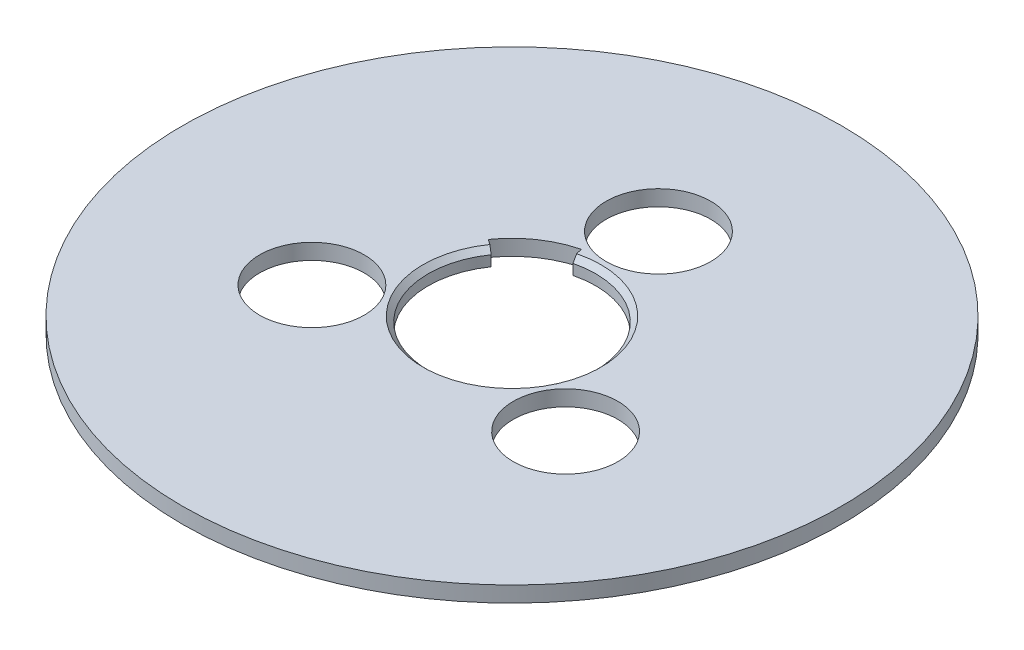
ISO-10303-21;
HEADER;
FILE_DESCRIPTION(('STEP AP214'),'2;1');
FILE_NAME('part.step','',(''),(''),'','','');
FILE_SCHEMA(('AUTOMOTIVE_DESIGN { 1 0 10303 214 1 1 1 1 }'));
ENDSEC;
DATA;
#1=APPLICATION_CONTEXT('core data for automotive mechanical design processes');
#2=APPLICATION_PROTOCOL_DEFINITION('international standard','automotive_design',2000,#1);
#3=PRODUCT_CONTEXT('',#1,'mechanical');
#4=PRODUCT('Part','Part','',(#3));
#5=PRODUCT_RELATED_PRODUCT_CATEGORY('part','',(#4));
#6=PRODUCT_DEFINITION_FORMATION('','',#4);
#7=PRODUCT_DEFINITION_CONTEXT('part definition',#1,'design');
#8=PRODUCT_DEFINITION('design','',#6,#7);
#9=PRODUCT_DEFINITION_SHAPE('','',#8);
#10=(LENGTH_UNIT() NAMED_UNIT(*) SI_UNIT(.MILLI.,.METRE.));
#11=(NAMED_UNIT(*) PLANE_ANGLE_UNIT() SI_UNIT($,.RADIAN.));
#12=(NAMED_UNIT(*) SI_UNIT($,.STERADIAN.) SOLID_ANGLE_UNIT());
#13=UNCERTAINTY_MEASURE_WITH_UNIT(LENGTH_MEASURE(1.E-05),#10,'distance_accuracy_value','');
#14=(GEOMETRIC_REPRESENTATION_CONTEXT(3) GLOBAL_UNCERTAINTY_ASSIGNED_CONTEXT((#13)) GLOBAL_UNIT_ASSIGNED_CONTEXT((#10,
#11,#12)) REPRESENTATION_CONTEXT('',''));
#15=CARTESIAN_POINT('',(0.,0.,0.));
#16=DIRECTION('',(0.,0.,1.));
#17=DIRECTION('',(1.,0.,0.));
#18=AXIS2_PLACEMENT_3D('',#15,#16,#17);
#19=CARTESIAN_POINT('',(0.,-1.5,0.));
#20=DIRECTION('',(0.,1.,0.));
#21=DIRECTION('',(0.,0.,1.));
#22=AXIS2_PLACEMENT_3D('',#19,#20,#21);
#23=CYLINDRICAL_SURFACE('',#22,31.5);
#24=CARTESIAN_POINT('',(0.,-1.5,0.));
#25=DIRECTION('',(0.,1.,0.));
#26=DIRECTION('',(0.,0.,1.));
#27=AXIS2_PLACEMENT_3D('',#24,#25,#26);
#28=CIRCLE('',#27,31.5);
#29=CARTESIAN_POINT('',(0.,-1.5,31.5));
#30=VERTEX_POINT('',#29);
#31=EDGE_CURVE('E122',#30,#30,#28,.T.);
#32=ORIENTED_EDGE('',*,*,#31,.T.);
#33=EDGE_LOOP('',(#32));
#34=FACE_BOUND('',#33,.T.);
#35=CARTESIAN_POINT('',(0.,0.,0.));
#36=DIRECTION('',(0.,1.,0.));
#37=DIRECTION('',(0.,0.,1.));
#38=AXIS2_PLACEMENT_3D('',#35,#36,#37);
#39=CIRCLE('',#38,31.5);
#40=CARTESIAN_POINT('',(0.,0.,31.5));
#41=VERTEX_POINT('',#40);
#42=EDGE_CURVE('E119',#41,#41,#39,.T.);
#43=ORIENTED_EDGE('',*,*,#42,.F.);
#44=EDGE_LOOP('',(#43));
#45=FACE_BOUND('',#44,.T.);
#46=ADVANCED_FACE('F33',(#34,#45),#23,.T.);
#47=CARTESIAN_POINT('',(0.,-1.5,0.));
#48=DIRECTION('',(0.,1.,0.));
#49=DIRECTION('',(0.,0.,1.));
#50=AXIS2_PLACEMENT_3D('',#47,#48,#49);
#51=PLANE('',#50);
#52=CARTESIAN_POINT('',(-12.1243556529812,-1.5,7.00000000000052));
#53=DIRECTION('',(0.,1.,0.));
#54=DIRECTION('',(0.,0.,1.));
#55=AXIS2_PLACEMENT_3D('',#52,#53,#54);
#56=CIRCLE('',#55,5.00000000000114);
#57=CARTESIAN_POINT('',(-12.1243556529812,-1.5,12.0000000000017));
#58=VERTEX_POINT('',#57);
#59=EDGE_CURVE('E171',#58,#58,#56,.T.);
#60=ORIENTED_EDGE('',*,*,#59,.T.);
#61=EDGE_LOOP('',(#60));
#62=FACE_BOUND('',#61,.T.);
#63=CARTESIAN_POINT('',(12.124355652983,-1.5,6.99999999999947));
#64=DIRECTION('',(0.,1.,0.));
#65=DIRECTION('',(0.,0.,1.));
#66=AXIS2_PLACEMENT_3D('',#63,#64,#65);
#67=CIRCLE('',#66,5.00000000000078);
#68=CARTESIAN_POINT('',(12.124355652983,-1.5,12.0000000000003));
#69=VERTEX_POINT('',#68);
#70=EDGE_CURVE('E179',#69,#69,#67,.T.);
#71=ORIENTED_EDGE('',*,*,#70,.T.);
#72=EDGE_LOOP('',(#71));
#73=FACE_BOUND('',#72,.T.);
#74=CARTESIAN_POINT('',(0.,-1.5,-14.));
#75=DIRECTION('',(0.,1.,0.));
#76=DIRECTION('',(0.,0.,1.));
#77=AXIS2_PLACEMENT_3D('',#74,#75,#76);
#78=CIRCLE('',#77,5.);
#79=CARTESIAN_POINT('',(0.,-1.5,-9.));
#80=VERTEX_POINT('',#79);
#81=EDGE_CURVE('E113',#80,#80,#78,.T.);
#82=ORIENTED_EDGE('',*,*,#81,.T.);
#83=EDGE_LOOP('',(#82));
#84=FACE_BOUND('',#83,.T.);
#85=DIRECTION('',(-0.242355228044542,0.,-0.970187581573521));
#86=VECTOR('',#85,1.);
#87=CARTESIAN_POINT('',(-1.93884182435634,-1.5,-7.76150065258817));
#88=LINE('',#87,#86);
#89=CARTESIAN_POINT('',(-1.93884182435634,-1.5,-7.76150065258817));
#90=VERTEX_POINT('',#89);
#91=CARTESIAN_POINT('',(-2.20543257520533,-1.5,-8.82870699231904));
#92=VERTEX_POINT('',#91);
#93=EDGE_CURVE('E91',#90,#92,#88,.T.);
#94=ORIENTED_EDGE('',*,*,#93,.T.);
#95=CARTESIAN_POINT('',(0.,-1.5,0.));
#96=DIRECTION('',(0.,1.,0.));
#97=DIRECTION('',(0.,0.,1.));
#98=AXIS2_PLACEMENT_3D('',#95,#96,#97);
#99=CIRCLE('',#98,9.1);
#100=CARTESIAN_POINT('',(-7.46680448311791,-1.5,-5.20161809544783));
#101=VERTEX_POINT('',#100);
#102=EDGE_CURVE('E97',#92,#101,#99,.T.);
#103=ORIENTED_EDGE('',*,*,#102,.T.);
#104=DIRECTION('',(0.820527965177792,0.,0.571606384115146));
#105=VECTOR('',#104,1.);
#106=CARTESIAN_POINT('',(-7.01059400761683,-1.5,-4.88380708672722));
#107=LINE('',#106,#105);
#108=CARTESIAN_POINT('',(-6.56422372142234,-1.5,-4.57285107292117));
#109=VERTEX_POINT('',#108);
#110=EDGE_CURVE('E103',#101,#109,#107,.T.);
#111=ORIENTED_EDGE('',*,*,#110,.T.);
#112=CARTESIAN_POINT('',(0.,-1.5,0.));
#113=DIRECTION('',(0.,1.,0.));
#114=DIRECTION('',(0.,0.,1.));
#115=AXIS2_PLACEMENT_3D('',#112,#113,#114);
#116=CIRCLE('',#115,8.);
#117=EDGE_CURVE('E83',#109,#90,#116,.T.);
#118=ORIENTED_EDGE('',*,*,#117,.T.);
#119=EDGE_LOOP('',(#94,#103,#111,#118));
#120=FACE_BOUND('',#119,.T.);
#121=ORIENTED_EDGE('',*,*,#31,.F.);
#122=EDGE_LOOP('',(#121));
#123=FACE_BOUND('',#122,.T.);
#124=ADVANCED_FACE('F100',(#62,#73,#84,#120,#123),#51,.F.);
#125=CARTESIAN_POINT('',(0.,0.,0.));
#126=DIRECTION('',(0.,1.,0.));
#127=DIRECTION('',(0.,0.,1.));
#128=AXIS2_PLACEMENT_3D('',#125,#126,#127);
#129=PLANE('',#128);
#130=CARTESIAN_POINT('',(-12.1243556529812,0.,7.00000000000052));
#131=DIRECTION('',(0.,1.,0.));
#132=DIRECTION('',(0.,0.,1.));
#133=AXIS2_PLACEMENT_3D('',#130,#131,#132);
#134=CIRCLE('',#133,5.00000000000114);
#135=CARTESIAN_POINT('',(-12.1243556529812,0.,12.0000000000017));
#136=VERTEX_POINT('',#135);
#137=EDGE_CURVE('E174',#136,#136,#134,.T.);
#138=ORIENTED_EDGE('',*,*,#137,.F.);
#139=EDGE_LOOP('',(#138));
#140=FACE_BOUND('',#139,.T.);
#141=CARTESIAN_POINT('',(12.124355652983,0.,6.99999999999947));
#142=DIRECTION('',(0.,1.,0.));
#143=DIRECTION('',(0.,0.,1.));
#144=AXIS2_PLACEMENT_3D('',#141,#142,#143);
#145=CIRCLE('',#144,5.00000000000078);
#146=CARTESIAN_POINT('',(12.124355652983,0.,12.0000000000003));
#147=VERTEX_POINT('',#146);
#148=EDGE_CURVE('E176',#147,#147,#145,.T.);
#149=ORIENTED_EDGE('',*,*,#148,.F.);
#150=EDGE_LOOP('',(#149));
#151=FACE_BOUND('',#150,.T.);
#152=CARTESIAN_POINT('',(0.,0.,-14.));
#153=DIRECTION('',(0.,1.,0.));
#154=DIRECTION('',(0.,0.,1.));
#155=AXIS2_PLACEMENT_3D('',#152,#153,#154);
#156=CIRCLE('',#155,5.);
#157=CARTESIAN_POINT('',(0.,0.,-9.));
#158=VERTEX_POINT('',#157);
#159=EDGE_CURVE('E182',#158,#158,#156,.T.);
#160=ORIENTED_EDGE('',*,*,#159,.F.);
#161=EDGE_LOOP('',(#160));
#162=FACE_BOUND('',#161,.T.);
#163=DIRECTION('',(-0.242355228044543,0.,-0.970187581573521));
#164=VECTOR('',#163,1.);
#165=CARTESIAN_POINT('',(-2.07068397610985,0.,-8.28928633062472));
#166=LINE('',#165,#164);
#167=CARTESIAN_POINT('',(-2.06001943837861,0.,-8.24659444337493));
#168=VERTEX_POINT('',#167);
#169=CARTESIAN_POINT('',(-2.20543257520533,0.,-8.82870699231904));
#170=VERTEX_POINT('',#169);
#171=EDGE_CURVE('E112',#168,#170,#166,.T.);
#172=ORIENTED_EDGE('',*,*,#171,.F.);
#173=CARTESIAN_POINT('',(0.,0.,0.));
#174=DIRECTION('',(0.,1.,0.));
#175=DIRECTION('',(0.,0.,1.));
#176=AXIS2_PLACEMENT_3D('',#173,#174,#175);
#177=CIRCLE('',#176,8.5);
#178=CARTESIAN_POINT('',(-6.97448770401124,0.,-4.85865426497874));
#179=VERTEX_POINT('',#178);
#180=EDGE_CURVE('E41',#168,#179,#177,.F.);
#181=ORIENTED_EDGE('',*,*,#180,.T.);
#182=DIRECTION('',(0.820527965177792,0.,0.571606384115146));
#183=VECTOR('',#182,1.);
#184=CARTESIAN_POINT('',(-6.56422372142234,0.,-4.57285107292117));
#185=LINE('',#184,#183);
#186=CARTESIAN_POINT('',(-7.46680448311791,0.,-5.20161809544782));
#187=VERTEX_POINT('',#186);
#188=EDGE_CURVE('E110',#187,#179,#185,.T.);
#189=ORIENTED_EDGE('',*,*,#188,.F.);
#190=CARTESIAN_POINT('',(0.,0.,0.));
#191=DIRECTION('',(0.,1.,0.));
#192=DIRECTION('',(0.,0.,1.));
#193=AXIS2_PLACEMENT_3D('',#190,#191,#192);
#194=CIRCLE('',#193,9.1);
#195=EDGE_CURVE('E105',#170,#187,#194,.T.);
#196=ORIENTED_EDGE('',*,*,#195,.F.);
#197=EDGE_LOOP('',(#172,#181,#189,#196));
#198=FACE_BOUND('',#197,.T.);
#199=ORIENTED_EDGE('',*,*,#42,.T.);
#200=EDGE_LOOP('',(#199));
#201=FACE_BOUND('',#200,.T.);
#202=ADVANCED_FACE('F130',(#140,#151,#162,#198,#201),#129,.T.);
#203=CARTESIAN_POINT('',(0.,-1.5,0.));
#204=DIRECTION('',(0.,1.,0.));
#205=DIRECTION('',(0.,0.,1.));
#206=AXIS2_PLACEMENT_3D('',#203,#204,#205);
#207=CYLINDRICAL_SURFACE('',#206,9.1);
#208=ORIENTED_EDGE('',*,*,#195,.T.);
#209=DIRECTION('',(0.,1.,0.));
#210=VECTOR('',#209,1.);
#211=CARTESIAN_POINT('',(-7.46680448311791,-1.5,-5.20161809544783));
#212=LINE('',#211,#210);
#213=EDGE_CURVE('E116',#101,#187,#212,.T.);
#214=ORIENTED_EDGE('',*,*,#213,.F.);
#215=ORIENTED_EDGE('',*,*,#102,.F.);
#216=DIRECTION('',(0.,1.,0.));
#217=VECTOR('',#216,1.);
#218=CARTESIAN_POINT('',(-2.20543257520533,-1.5,-8.82870699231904));
#219=LINE('',#218,#217);
#220=EDGE_CURVE('E87',#92,#170,#219,.T.);
#221=ORIENTED_EDGE('',*,*,#220,.T.);
#222=EDGE_LOOP('',(#208,#214,#215,#221));
#223=FACE_BOUND('',#222,.T.);
#224=ADVANCED_FACE('F141',(#223),#207,.F.);
#225=CARTESIAN_POINT('',(-2.07068397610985,-1.5,-8.28928633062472));
#226=DIRECTION('',(0.970187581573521,0.,-0.242355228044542));
#227=DIRECTION('',(-0.242355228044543,0.,-0.970187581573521));
#228=AXIS2_PLACEMENT_3D('',#225,#226,#227);
#229=PLANE('',#228);
#230=DIRECTION('',(0.,1.,0.));
#231=VECTOR('',#230,1.);
#232=CARTESIAN_POINT('',(-1.93884182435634,-1.5,-7.76150065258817));
#233=LINE('',#232,#231);
#234=CARTESIAN_POINT('',(-1.93884182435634,-0.499999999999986,-7.76150065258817));
#235=VERTEX_POINT('',#234);
#236=EDGE_CURVE('E78',#90,#235,#233,.T.);
#237=ORIENTED_EDGE('',*,*,#236,.T.);
#238=DIRECTION('',(-0.171371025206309,0.707106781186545,-0.686026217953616));
#239=VECTOR('',#238,1.);
#240=CARTESIAN_POINT('',(0.,-8.49999999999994,0.));
#241=LINE('',#240,#239);
#242=EDGE_CURVE('E55',#235,#168,#241,.T.);
#243=ORIENTED_EDGE('',*,*,#242,.T.);
#244=ORIENTED_EDGE('',*,*,#171,.T.);
#245=ORIENTED_EDGE('',*,*,#220,.F.);
#246=ORIENTED_EDGE('',*,*,#93,.F.);
#247=EDGE_LOOP('',(#237,#243,#244,#245,#246));
#248=FACE_BOUND('',#247,.T.);
#249=ADVANCED_FACE('F92',(#248),#229,.F.);
#250=CARTESIAN_POINT('',(0.,-1.5,0.));
#251=DIRECTION('',(0.,1.,0.));
#252=DIRECTION('',(0.,0.,1.));
#253=AXIS2_PLACEMENT_3D('',#250,#251,#252);
#254=CYLINDRICAL_SURFACE('',#253,8.);
#255=DIRECTION('',(0.,1.,0.));
#256=VECTOR('',#255,1.);
#257=CARTESIAN_POINT('',(-6.56422372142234,-1.5,-4.57285107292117));
#258=LINE('',#257,#256);
#259=CARTESIAN_POINT('',(-6.56422372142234,-0.499999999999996,-4.57285107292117));
#260=VERTEX_POINT('',#259);
#261=EDGE_CURVE('E88',#109,#260,#258,.T.);
#262=ORIENTED_EDGE('',*,*,#261,.T.);
#263=CARTESIAN_POINT('',(0.,-0.499999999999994,0.));
#264=DIRECTION('',(0.,1.,0.));
#265=DIRECTION('',(0.,0.,1.));
#266=AXIS2_PLACEMENT_3D('',#263,#264,#265);
#267=CIRCLE('',#266,8.);
#268=EDGE_CURVE('E86',#260,#235,#267,.T.);
#269=ORIENTED_EDGE('',*,*,#268,.T.);
#270=ORIENTED_EDGE('',*,*,#236,.F.);
#271=ORIENTED_EDGE('',*,*,#117,.F.);
#272=EDGE_LOOP('',(#262,#269,#270,#271));
#273=FACE_BOUND('',#272,.T.);
#274=ADVANCED_FACE('F81',(#273),#254,.F.);
#275=CARTESIAN_POINT('',(-6.56422372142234,-1.5,-4.57285107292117));
#276=DIRECTION('',(-0.571606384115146,0.,0.820527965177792));
#277=DIRECTION('',(0.820527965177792,0.,0.571606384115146));
#278=AXIS2_PLACEMENT_3D('',#275,#276,#277);
#279=PLANE('',#278);
#280=ORIENTED_EDGE('',*,*,#188,.T.);
#281=DIRECTION('',(0.580200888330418,-0.707106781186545,0.404186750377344));
#282=VECTOR('',#281,1.);
#283=CARTESIAN_POINT('',(0.,-8.49999999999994,0.));
#284=LINE('',#283,#282);
#285=EDGE_CURVE('E11',#179,#260,#284,.T.);
#286=ORIENTED_EDGE('',*,*,#285,.T.);
#287=ORIENTED_EDGE('',*,*,#261,.F.);
#288=ORIENTED_EDGE('',*,*,#110,.F.);
#289=ORIENTED_EDGE('',*,*,#213,.T.);
#290=EDGE_LOOP('',(#280,#286,#287,#288,#289));
#291=FACE_BOUND('',#290,.T.);
#292=ADVANCED_FACE('F144',(#291),#279,.F.);
#293=CARTESIAN_POINT('',(0.,-0.499999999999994,0.));
#294=DIRECTION('',(0.,1.,0.));
#295=DIRECTION('',(0.,0.,1.));
#296=AXIS2_PLACEMENT_3D('',#293,#294,#295);
#297=CONICAL_SURFACE('',#296,8.,0.785398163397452);
#298=ORIENTED_EDGE('',*,*,#285,.F.);
#299=ORIENTED_EDGE('',*,*,#180,.F.);
#300=ORIENTED_EDGE('',*,*,#242,.F.);
#301=ORIENTED_EDGE('',*,*,#268,.F.);
#302=EDGE_LOOP('',(#298,#299,#300,#301));
#303=FACE_BOUND('',#302,.T.);
#304=ADVANCED_FACE('F35',(#303),#297,.F.);
#305=CARTESIAN_POINT('',(0.,-1.5,-14.));
#306=DIRECTION('',(0.,1.,0.));
#307=DIRECTION('',(0.,0.,1.));
#308=AXIS2_PLACEMENT_3D('',#305,#306,#307);
#309=CYLINDRICAL_SURFACE('',#308,5.);
#310=ORIENTED_EDGE('',*,*,#81,.F.);
#311=EDGE_LOOP('',(#310));
#312=FACE_BOUND('',#311,.T.);
#313=ORIENTED_EDGE('',*,*,#159,.T.);
#314=EDGE_LOOP('',(#313));
#315=FACE_BOUND('',#314,.T.);
#316=ADVANCED_FACE('F155',(#312,#315),#309,.F.);
#317=CARTESIAN_POINT('',(12.124355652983,-1.5,6.99999999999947));
#318=DIRECTION('',(0.,1.,0.));
#319=DIRECTION('',(0.,0.,1.));
#320=AXIS2_PLACEMENT_3D('',#317,#318,#319);
#321=CYLINDRICAL_SURFACE('',#320,5.00000000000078);
#322=ORIENTED_EDGE('',*,*,#70,.F.);
#323=EDGE_LOOP('',(#322));
#324=FACE_BOUND('',#323,.T.);
#325=ORIENTED_EDGE('',*,*,#148,.T.);
#326=EDGE_LOOP('',(#325));
#327=FACE_BOUND('',#326,.T.);
#328=ADVANCED_FACE('F158',(#324,#327),#321,.F.);
#329=CARTESIAN_POINT('',(-12.1243556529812,-1.5,7.00000000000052));
#330=DIRECTION('',(0.,1.,0.));
#331=DIRECTION('',(0.,0.,1.));
#332=AXIS2_PLACEMENT_3D('',#329,#330,#331);
#333=CYLINDRICAL_SURFACE('',#332,5.00000000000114);
#334=ORIENTED_EDGE('',*,*,#59,.F.);
#335=EDGE_LOOP('',(#334));
#336=FACE_BOUND('',#335,.T.);
#337=ORIENTED_EDGE('',*,*,#137,.T.);
#338=EDGE_LOOP('',(#337));
#339=FACE_BOUND('',#338,.T.);
#340=ADVANCED_FACE('F162',(#336,#339),#333,.F.);
#341=CLOSED_SHELL('',(#46,#124,#202,#224,#249,#274,#292,#304,#316,#328,#340));
#342=MANIFOLD_SOLID_BREP('B2',#341);
#343=ADVANCED_BREP_SHAPE_REPRESENTATION('',(#18,#342),#14);
#344=SHAPE_DEFINITION_REPRESENTATION(#9,#343);
ENDSEC;
END-ISO-10303-21;
